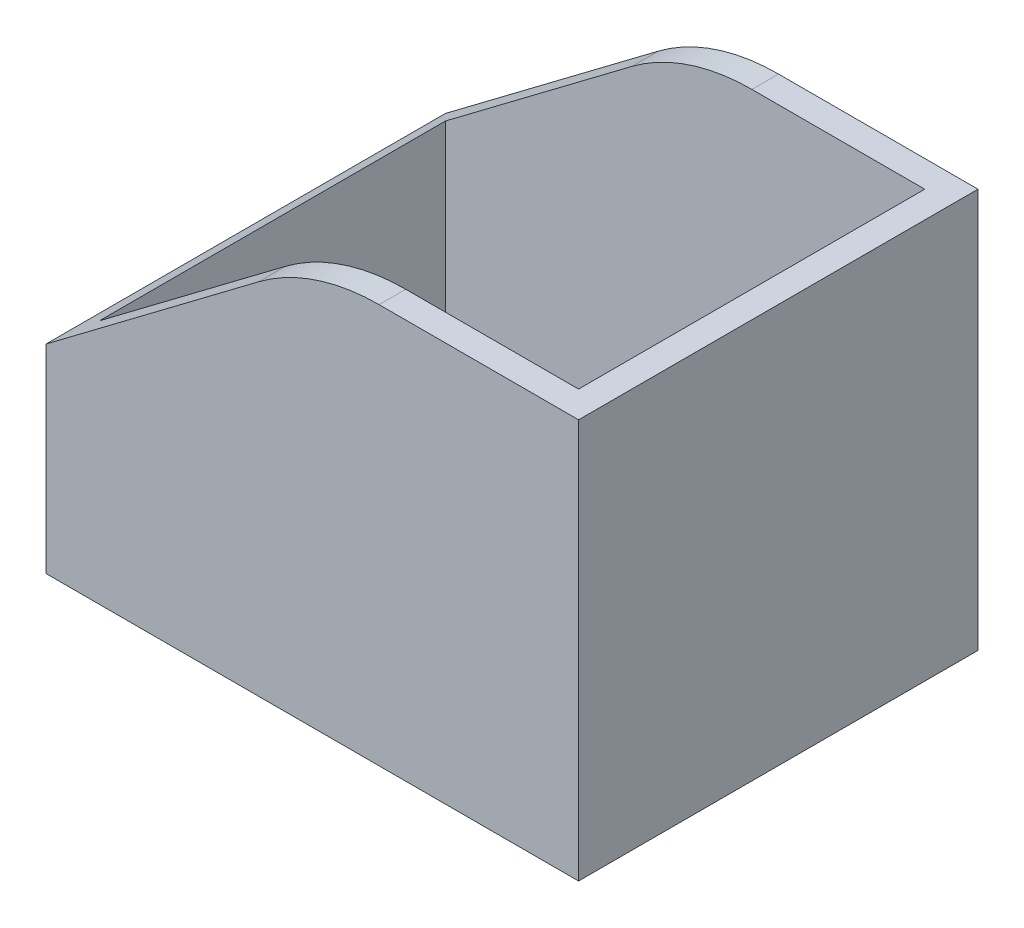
from build123d import *

# Parameters (mm, degrees)
ESQUISSE1_W        = 80
ESQUISSE1_H        = 60
BOSS_EXTRU_1_DEPTH = 60
CHANFREIN1_SIZE    = 40
CHANFREIN1_SIZE2   = 30.142162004
COQUE1_T           = -4
CONG_1_R           = 30


with BuildPart() as part:
    # Esquisse1 → Boss.-Extru.1 (new body)
    with BuildSketch(Plane.XY):
        with Locations((40, 30)):
            Rectangle(ESQUISSE1_W, ESQUISSE1_H)
    extrude(amount=BOSS_EXTRU_1_DEPTH)

    # Chanfrein1
    chanfrein1_edges = [part.edges().sort_by_distance(p)[0] for p in [
        (0, 60, 30),
    ]]
    chanfrein1_side = [part.faces().sort_by_distance(p)[0] for p in [
        (40, 60, 30),
    ]]
    chamfer(chanfrein1_edges, length=CHANFREIN1_SIZE, length2=CHANFREIN1_SIZE2, reference=chanfrein1_side[0])

    # Coque1
    coque1_openings = [part.faces().sort_by_distance(p)[0] for p in [
        (20, 44.928918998, 30),
        (60, 60, 30),
    ]]
    offset(amount=COQUE1_T, openings=coque1_openings, kind=Kind.INTERSECTION)

    # Cong_1
    cong_1_edges = [part.edges().sort_by_distance(p)[0] for p in [
        (40, 60, 2),
        (40, 60, 58),
    ]]
    fillet(cong_1_edges, radius=CONG_1_R)


solid = part.part
